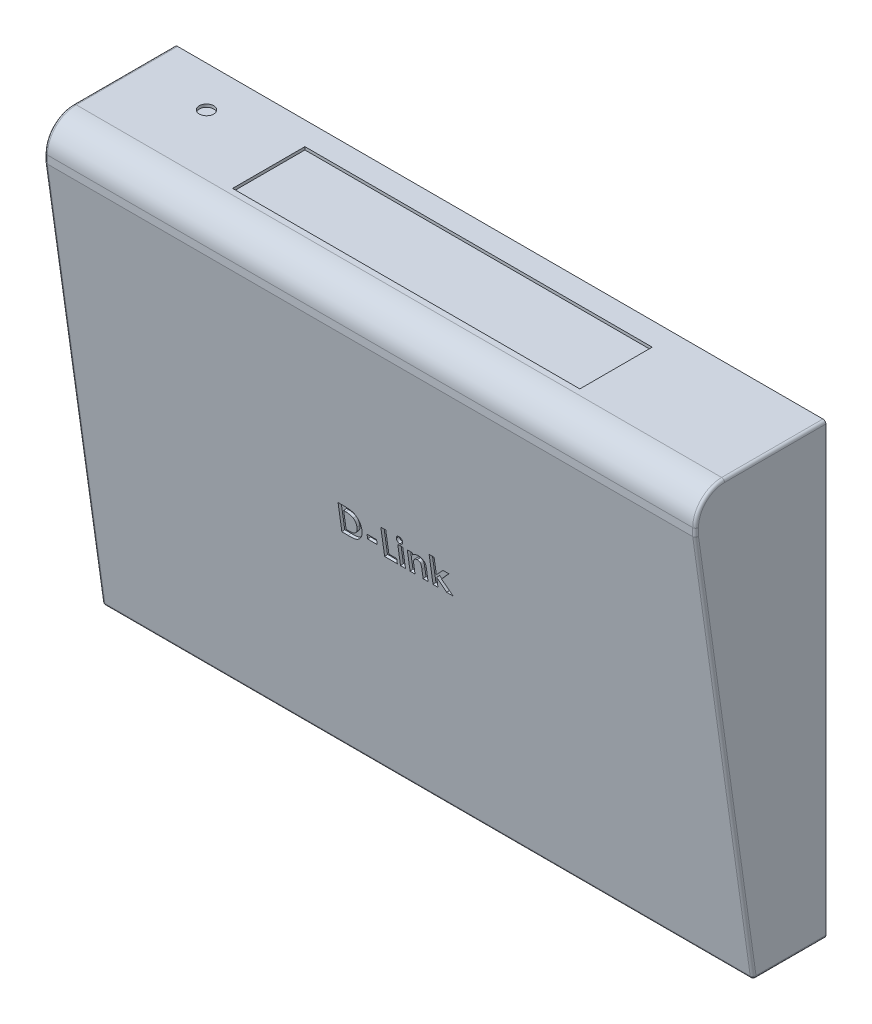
from build123d import *

# Parameters (mm, degrees)
SKETCH2_W           = 225
SKETCH2_H           = 155
BOSS_EXTRUDE1_DEPTH = 45
CHAMFER1_SIZE       = 20
CHAMFER1_SIZE2      = 142.307394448
FILLET1_R           = 10
FILLET2_R           = 1
SKETCH3_W           = 3.297115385
SKETCH3_H           = 1.5875
SKETCH3_W_2         = 1.709615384
SKETCH3_H_2         = 6.960576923
CUT_EXTRUDE1_DEPTH  = 1
SKETCH4_W           = 120
SKETCH4_H           = 25
CUT_EXTRUDE2_DEPTH  = 1
SKETCH5_R           = 2.5
CUT_EXTRUDE3_DEPTH  = 1
SKETCH6_R           = 4
CUT_EXTRUDE4_DEPTH  = 5
SKETCH7_RX          = 8
SKETCH7_RY          = 4
BOSS_EXTRUDE2_DEPTH = 3


with BuildPart() as part:
    # Sketch2 → Boss-Extrude1 (new body)
    with BuildSketch(Plane.XY):
        with Locations((67.04887218, -31.077694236)):
            Rectangle(SKETCH2_W, SKETCH2_H)
    extrude(amount=BOSS_EXTRUDE1_DEPTH)

    # Chamfer1
    chamfer1_edges = [part.edges().sort_by_distance(p)[0] for p in [
        (67.04887218, -108.577694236, 45),
    ]]
    chamfer1_side = [part.faces().sort_by_distance(p)[0] for p in [
        (67.04887218, -108.577694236, 22.5),
    ]]
    chamfer(chamfer1_edges, length=CHAMFER1_SIZE, length2=CHAMFER1_SIZE2, reference=chamfer1_side[0])

    # Fillet1
    fillet1_edges = [part.edges().sort_by_distance(p)[0] for p in [
        (67.04887218, 46.422305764, 45),
    ]]
    fillet(fillet1_edges, radius=FILLET1_R)

    # Fillet2
    fillet2_edges = [part.edges().sort_by_distance(p)[0] for p in [
        (179.54887218, 35.076002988, 45),
        (179.54887218, -108.577694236, 12.5),
        (179.54887218, -37.423997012, 35),
        (-45.45112782, -108.577694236, 12.5),
        (67.04887218, -108.577694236, 25),
        (-45.45112782, -37.423997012, 35),
        (-45.45112782, 35.076002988, 45),
        (-45.45112782, 46.422305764, 17.5),
        (-45.45112782, 43.493373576, 42.071067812),
        (179.54887218, 46.422305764, 17.5),
        (179.54887218, 43.493373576, 42.071067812),
    ]]
    fillet(fillet2_edges, radius=FILLET2_R)

    # Sketch3 → Cut-Extrude1 (cut)
    # profile 1 of 7: a face of its own
    with BuildSketch(Plane(origin=(0, -5.548524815, 39.479805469), x_dir=(1, 0, 0), z_dir=(0, -0.1391731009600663, 0.9902680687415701))):
        with BuildLine():
            Line((47.642465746, -20.347282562), (49.796657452, -20.347282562))
            add(Edge.make_bspline(
                [(49.796657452, -20.347282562), (49.964601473, -20.348456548), (50.289239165, -20.350725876), (50.759574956, -20.376295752), (51.19692739, -20.415620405), (51.601578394, -20.469718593), (51.972698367, -20.541305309), (52.309808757, -20.631096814), (52.614040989, -20.734746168), (52.888730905, -20.856710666), (53.139496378, -20.998909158), (53.377606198, -21.157306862), (53.602592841, -21.337706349), (53.81761364, -21.536627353), (54.019893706, -21.757709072), (54.212801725, -21.997289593), (54.391614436, -22.258843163), (54.561736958, -22.536098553), (54.715590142, -22.830230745), (54.849786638, -23.138736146), (54.962203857, -23.45962941), (55.053548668, -23.793252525), (55.126361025, -24.138497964), (55.177306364, -24.4960624), (55.20880128, -24.865614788), (55.211996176, -25.116078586), (55.213619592, -25.243346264)],
                knots=[0, 0, 0, 0, 1.44355588, 2.790409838, 4.047694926, 5.217575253, 6.298404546, 7.294384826, 8.214239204, 9.058592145, 9.873746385, 10.689560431, 11.514393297, 12.350027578, 13.205127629, 14.088021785, 14.991911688, 15.926770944, 16.882954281, 17.842803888, 18.816321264, 19.80318086, 20.814351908, 21.847355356, 22.906180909, 24, 24, 24, 24], degree=3))
            add(Edge.make_bspline(
                [(55.213619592, -25.243346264), (55.209368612, -25.422929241), (55.201000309, -25.776448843), (55.130510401, -26.295234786), (55.016504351, -26.792542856), (54.856201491, -27.264482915), (54.657468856, -27.706852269), (54.42006047, -28.111849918), (54.147457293, -28.477302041), (53.842835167, -28.801388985), (53.513003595, -29.079946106), (53.170242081, -29.318509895), (52.811211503, -29.50663735), (52.494855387, -29.625938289), (52.220535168, -29.700133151), (51.979684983, -29.743983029), (51.706103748, -29.784196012), (51.397240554, -29.81527174), (51.054450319, -29.842983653), (50.676366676, -29.858041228), (50.264213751, -29.870551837), (49.977934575, -29.871690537), (49.829094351, -29.872282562)],
                knots=[0, 0, 0, 0, 1.315458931, 2.589557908, 3.828601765, 5.048913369, 6.235739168, 7.376350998, 8.481830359, 9.569842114, 10.627874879, 11.640079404, 12.624025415, 13.590060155, 14.111227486, 14.704434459, 15.382649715, 16.137166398, 16.978595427, 17.902333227, 18.909396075, 20, 20, 20, 20], degree=3))
            Line((49.829094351, -29.872282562), (47.642465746, -29.872282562))
            Line((47.642465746, -29.872282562), (47.642465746, -20.347282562))
        make_face()
        with BuildLine():
            Line((49.35208113, -22.056897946), (49.35208113, -28.162667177))
            Line((49.35208113, -28.162667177), (50.24504988, -28.162667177))
            add(Edge.make_bspline(
                [(50.24504988, -28.162667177), (50.351299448, -28.162472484), (50.555652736, -28.162098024), (50.850692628, -28.144262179), (51.123529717, -28.126359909), (51.373412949, -28.092380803), (51.602160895, -28.054530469), (51.806631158, -28.001856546), (51.991038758, -27.946527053), (52.153131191, -27.87608575), (52.301594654, -27.796799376), (52.439054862, -27.703906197), (52.571742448, -27.600751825), (52.697176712, -27.484302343), (52.815832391, -27.356099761), (52.927007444, -27.215483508), (53.032185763, -27.062882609), (53.12866762, -26.897490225), (53.216833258, -26.721052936), (53.295046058, -26.535279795), (53.35989601, -26.338623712), (53.41379532, -26.132925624), (53.452312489, -25.916394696), (53.4841781, -25.690634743), (53.50060575, -25.454751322), (53.502860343, -25.294248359), (53.504004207, -25.212817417)],
                knots=[0, 0, 0, 0, 1.50275155, 2.890291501, 4.180787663, 5.369391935, 6.45668281, 7.458360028, 8.354766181, 9.177074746, 9.954075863, 10.732690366, 11.5210699, 12.329727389, 13.151100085, 13.990027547, 14.863562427, 15.770965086, 16.696477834, 17.652329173, 18.619756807, 19.62365428, 20.657822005, 21.729286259, 22.847956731, 24, 24, 24, 24], degree=3))
            add(Edge.make_bspline(
                [(53.504004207, -25.212817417), (53.501726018, -25.088032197), (53.497283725, -24.844710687), (53.454443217, -24.490307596), (53.384707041, -24.156583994), (53.285200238, -23.844778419), (53.159768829, -23.554014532), (53.00276218, -23.286755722), (52.820937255, -23.038512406), (52.677155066, -22.892884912), (52.605311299, -22.8201191)],
                knots=[0, 0, 0, 0, 1.13821349, 2.219428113, 3.251817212, 4.244760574, 5.201143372, 6.134805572, 7.068016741, 8, 8, 8, 8], degree=3))
            add(Edge.make_bspline(
                [(52.605311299, -22.8201191), (52.534466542, -22.758112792), (52.389774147, -22.631471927), (52.135741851, -22.479723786), (51.855811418, -22.346398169), (51.543578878, -22.240685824), (51.20206182, -22.157083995), (50.829226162, -22.099425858), (50.427068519, -22.06237535), (50.148463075, -22.058762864), (50.004635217, -22.056897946)],
                knots=[0, 0, 0, 0, 0.813307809, 1.661089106, 2.549956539, 3.493439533, 4.508053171, 5.589449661, 6.755572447, 8, 8, 8, 8], degree=3))
            Line((50.004635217, -22.056897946), (49.35208113, -22.056897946))
        make_face(mode=Mode.SUBTRACT)
    # profile 2 of 7: a face of its own
    with BuildSketch(Plane(origin=(0, -5.548524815, 39.479805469), x_dir=(1, 0, 0), z_dir=(0, -0.1391731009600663, 0.9902680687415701))):
        with Locations((58.571792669, -26.3919941)):
            Rectangle(SKETCH3_W, SKETCH3_H)
    # profile 3 of 7: a face of its own
    with BuildSketch(Plane(origin=(0, -5.548524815, 39.479805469), x_dir=(1, 0, 0), z_dir=(0, -0.1391731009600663, 0.9902680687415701))):
        Polygon((62.418427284, -20.347282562), (64.128042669, -20.347282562), (64.128042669, -28.162667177), (66.81458113, -28.162667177), (66.81458113, -29.872282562), (62.418427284, -29.872282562), align=None)
    # profile 4 of 7: a face of its own
    with BuildSketch(Plane(origin=(0, -5.548524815, 39.479805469), x_dir=(1, 0, 0), z_dir=(0, -0.1391731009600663, 0.9902680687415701))):
        with BuildLine():
            add(Edge.make_bspline(
                [(68.764611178, -19.980936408), (68.838295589, -19.984551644), (68.98298203, -19.991650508), (69.190265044, -20.060848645), (69.380508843, -20.169453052), (69.548689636, -20.318460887), (69.688566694, -20.496403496), (69.795437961, -20.695622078), (69.854971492, -20.91634985), (69.863239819, -21.068826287), (69.867465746, -21.14675672)],
                knots=[0, 0, 0, 0, 0.989868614, 1.943702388, 2.910836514, 3.924849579, 4.949916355, 5.946401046, 6.950409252, 8, 8, 8, 8], degree=3))
            add(Edge.make_bspline(
                [(69.867465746, -21.14675672), (69.863391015, -21.22411285), (69.855451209, -21.374844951), (69.79406776, -21.592576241), (69.691485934, -21.791698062), (69.55047596, -21.966997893), (69.384118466, -22.11360587), (69.19803164, -22.224181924), (68.992734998, -22.289530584), (68.850293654, -22.297222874), (68.777967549, -22.301128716)],
                knots=[0, 0, 0, 0, 1.05296456, 2.051751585, 3.055639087, 4.085634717, 5.099016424, 6.062201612, 7.016062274, 8, 8, 8, 8], degree=3))
            add(Edge.make_bspline(
                [(68.777967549, -22.301128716), (68.703639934, -22.297526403), (68.557694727, -22.290453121), (68.348711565, -22.221093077), (68.155930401, -22.113344), (67.988479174, -21.961291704), (67.847000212, -21.782084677), (67.744797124, -21.578228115), (67.680866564, -21.355991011), (67.673278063, -21.201256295), (67.669388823, -21.121952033)],
                knots=[0, 0, 0, 0, 0.989065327, 1.942068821, 2.907541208, 3.917690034, 4.939857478, 5.938239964, 6.943311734, 8, 8, 8, 8], degree=3))
            add(Edge.make_bspline(
                [(67.669388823, -21.121952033), (67.673621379, -21.045909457), (67.681935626, -20.896534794), (67.741825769, -20.680714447), (67.846246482, -20.484845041), (67.985115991, -20.310159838), (68.151819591, -20.163931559), (68.341949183, -20.058625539), (68.547837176, -19.992285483), (68.69160708, -19.984758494), (68.764611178, -19.980936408)],
                knots=[0, 0, 0, 0, 1.038616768, 2.040212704, 3.031499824, 4.052181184, 5.074969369, 6.039807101, 7.004644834, 8, 8, 8, 8], degree=3))
        make_face()
    # profile 5 of 7: a face of its own
    with BuildSketch(Plane(origin=(0, -5.548524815, 39.479805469), x_dir=(1, 0, 0), z_dir=(0, -0.1391731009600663, 0.9902680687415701))):
        with Locations((68.768427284, -26.3919941)):
            Rectangle(SKETCH3_W_2, SKETCH3_H_2)
    # profile 6 of 7: a face of its own
    with BuildSketch(Plane(origin=(0, -5.548524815, 39.479805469), x_dir=(1, 0, 0), z_dir=(0, -0.1391731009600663, 0.9902680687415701))):
        with BuildLine():
            Line((71.210734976, -22.911705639), (72.920350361, -22.911705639))
            Line((72.920350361, -22.911705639), (72.920350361, -23.648214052))
            add(Edge.make_bspline(
                [(72.920350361, -23.648214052), (73.017883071, -23.572351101), (73.20428704, -23.427362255), (73.487653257, -23.242500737), (73.755115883, -23.091199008), (74.012636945, -22.97611117), (74.265061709, -22.893310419), (74.516478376, -22.83382302), (74.770631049, -22.795731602), (74.941483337, -22.791636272), (75.026840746, -22.789590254)],
                knots=[0, 0, 0, 0, 1.276643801, 2.439914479, 3.493451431, 4.44993799, 5.350072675, 6.235028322, 7.118224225, 8, 8, 8, 8], degree=3))
            add(Edge.make_bspline(
                [(75.026840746, -22.789590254), (75.11342435, -22.791928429), (75.283395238, -22.796518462), (75.533668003, -22.828622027), (75.772779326, -22.887092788), (76.003417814, -22.964726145), (76.223235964, -23.067197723), (76.434926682, -23.188866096), (76.633942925, -23.337066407), (76.756505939, -23.449928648), (76.818502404, -23.507018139)],
                knots=[0, 0, 0, 0, 1.048836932, 2.058954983, 3.049370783, 4.026390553, 5.001981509, 5.982488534, 6.97947532, 8, 8, 8, 8], degree=3))
            add(Edge.make_bspline(
                [(76.818502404, -23.507018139), (76.868225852, -23.559923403), (76.968036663, -23.666121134), (77.093636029, -23.847852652), (77.201414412, -24.045973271), (77.289723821, -24.262768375), (77.354980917, -24.499429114), (77.405184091, -24.753096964), (77.433353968, -25.025192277), (77.436831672, -25.21211919), (77.438619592, -25.308220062)],
                knots=[0, 0, 0, 0, 0.889584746, 1.785680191, 2.700364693, 3.65222533, 4.649950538, 5.707241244, 6.821271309, 8, 8, 8, 8], degree=3))
            Line((77.438619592, -25.308220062), (77.438619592, -29.872282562))
            Line((77.438619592, -29.872282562), (75.729004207, -29.872282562))
            Line((75.729004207, -29.872282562), (75.729004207, -26.849926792))
            add(Edge.make_bspline(
                [(75.729004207, -26.849926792), (75.728642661, -26.751342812), (75.727949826, -26.562424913), (75.722630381, -26.292055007), (75.712243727, -26.04787587), (75.702776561, -25.829442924), (75.684188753, -25.637531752), (75.667425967, -25.470927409), (75.641705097, -25.331141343), (75.608238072, -25.180780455), (75.549796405, -25.019791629), (75.459068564, -24.850163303), (75.343967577, -24.706060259), (75.209194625, -24.586472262), (75.054898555, -24.491867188), (74.882943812, -24.425306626), (74.694252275, -24.383824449), (74.56277423, -24.379392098), (74.494493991, -24.377090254)],
                knots=[0, 0, 0, 0, 1.49886392, 2.872294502, 4.110984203, 5.214877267, 6.195405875, 7.042225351, 7.75923308, 8.355011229, 9.382752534, 10.352059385, 11.267231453, 12.171456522, 13.078624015, 14.003401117, 14.963110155, 16, 16, 16, 16], degree=3))
            add(Edge.make_bspline(
                [(74.494493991, -24.377090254), (74.405692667, -24.381593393), (74.231980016, -24.390402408), (73.980739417, -24.456830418), (73.749979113, -24.569804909), (73.541584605, -24.726138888), (73.357540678, -24.919152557), (73.205957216, -25.149343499), (73.081627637, -25.411156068), (73.02816407, -25.60232177), (73.000488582, -25.701278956)],
                knots=[0, 0, 0, 0, 0.984188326, 1.925263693, 2.85911992, 3.81709677, 4.80007086, 5.801799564, 6.862098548, 8, 8, 8, 8], degree=3))
            add(Edge.make_bspline(
                [(73.000488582, -25.701278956), (72.993610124, -25.732357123), (72.978269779, -25.801667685), (72.965654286, -25.918760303), (72.948105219, -26.057679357), (72.941530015, -26.220938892), (72.930096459, -26.407766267), (72.925867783, -26.618408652), (72.921631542, -26.852453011), (72.920791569, -27.015924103), (72.920350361, -27.101789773)],
                knots=[0, 0, 0, 0, 0.543362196, 1.211806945, 2.009705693, 2.934833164, 4.000995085, 5.207458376, 6.533175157, 8, 8, 8, 8], degree=3))
            Line((72.920350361, -27.101789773), (72.920350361, -29.872282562))
            Line((72.920350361, -29.872282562), (71.210734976, -29.872282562))
            Line((71.210734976, -29.872282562), (71.210734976, -22.911705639))
        make_face()
    # profile 7 of 7: a face of its own
    with BuildSketch(Plane(origin=(0, -5.548524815, 39.479805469), x_dir=(1, 0, 0), z_dir=(0, -0.1391731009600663, 0.9902680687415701))):
        Polygon((79.148234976, -20.103051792), (80.857850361, -20.103051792), (80.857850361, -25.800497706), (83.517676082, -22.911705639), (85.629890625, -22.911705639), (82.575097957, -26.229809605), (86.066834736, -29.872282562), (83.914551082, -29.872282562), (80.857850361, -26.683926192), (80.857850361, -29.872282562), (79.148234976, -29.872282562), align=None)
    extrude(amount=-CUT_EXTRUDE1_DEPTH, mode=Mode.SUBTRACT)

    # Sketch4 → Cut-Extrude2 (cut)
    with BuildSketch(Plane(origin=(0, 46.422305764, 0), x_dir=(1, 0, 0), z_dir=(0, 1, 0))):
        with Locations((67.54887218, -20.5)):
            Rectangle(SKETCH4_W, SKETCH4_H)
    extrude(amount=-CUT_EXTRUDE2_DEPTH, mode=Mode.SUBTRACT)

    # Sketch5 → Cut-Extrude3 (cut)
    with BuildSketch(Plane(origin=(0, 46.422305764, 0), x_dir=(1, 0, 0), z_dir=(0, 1, 0))):
        with Locations(Location((-20.45112782, -14, 0), (0, 0, 270))):
            Circle(SKETCH5_R)
    extrude(amount=-CUT_EXTRUDE3_DEPTH, mode=Mode.SUBTRACT)

    # Sketch6 → Cut-Extrude4 (cut)
    with BuildSketch(Plane(origin=(0, 0, 0), x_dir=(-1, 0, 0), z_dir=(0, 0, -1))):
        with Locations((-157.04887218, -31.577694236)):
            Circle(SKETCH6_R)
        with Locations((22.95112782, -31.577694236)):
            Circle(SKETCH6_R)
    extrude(amount=-CUT_EXTRUDE4_DEPTH, mode=Mode.SUBTRACT)

    # Sketch7 → Boss-Extrude2 (add)
    with BuildSketch(Plane(origin=(0, 0, 0), x_dir=(-1, 0, 0), z_dir=(0, 0, -1))):
        with Locations(Location((-164.54887218, 26.422305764), (0, 0, -90))):
            Ellipse(SKETCH7_RX, SKETCH7_RY)
        with Locations(Location((-164.54887218, -88.577694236), (0, 0, -90))):
            Ellipse(SKETCH7_RX, SKETCH7_RY)
        with Locations(Location((30.45112782, 26.422305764), (0, 0, -90))):
            Ellipse(SKETCH7_RX, SKETCH7_RY)
        with Locations(Location((30.45112782, -88.577694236), (0, 0, -90))):
            Ellipse(SKETCH7_RX, SKETCH7_RY)
    extrude(amount=BOSS_EXTRUDE2_DEPTH)


solid = part.part
